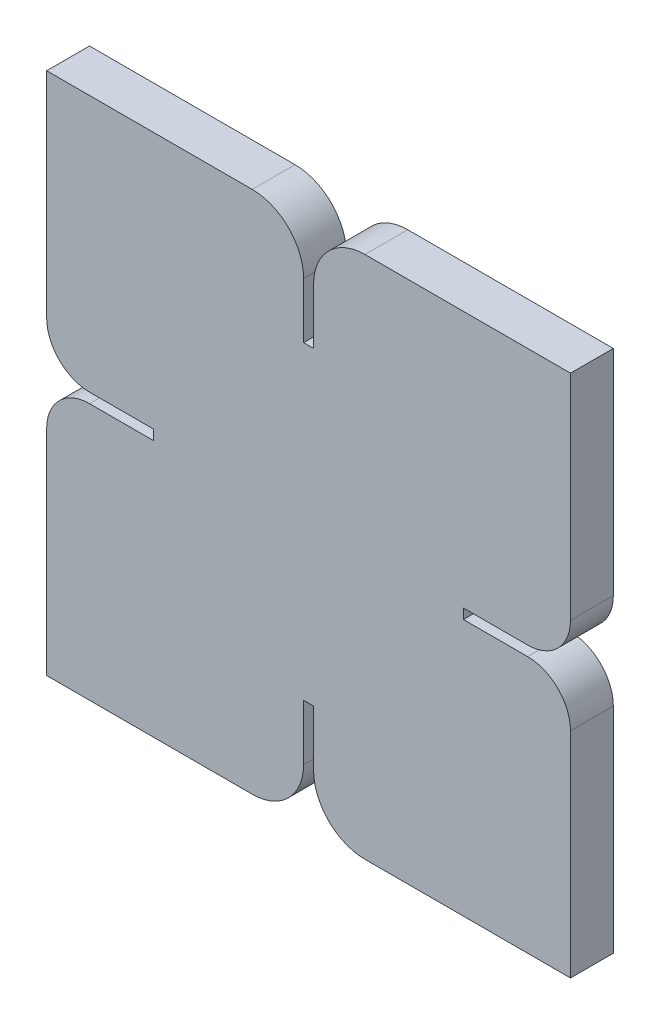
ISO-10303-21;
HEADER;
FILE_DESCRIPTION(('STEP AP214'),'2;1');
FILE_NAME('part.step','',(''),(''),'','','');
FILE_SCHEMA(('AUTOMOTIVE_DESIGN { 1 0 10303 214 1 1 1 1 }'));
ENDSEC;
DATA;
#1=APPLICATION_CONTEXT('core data for automotive mechanical design processes');
#2=APPLICATION_PROTOCOL_DEFINITION('international standard','automotive_design',2000,#1);
#3=PRODUCT_CONTEXT('',#1,'mechanical');
#4=PRODUCT('Part','Part','',(#3));
#5=PRODUCT_RELATED_PRODUCT_CATEGORY('part','',(#4));
#6=PRODUCT_DEFINITION_FORMATION('','',#4);
#7=PRODUCT_DEFINITION_CONTEXT('part definition',#1,'design');
#8=PRODUCT_DEFINITION('design','',#6,#7);
#9=PRODUCT_DEFINITION_SHAPE('','',#8);
#10=(LENGTH_UNIT() NAMED_UNIT(*) SI_UNIT(.MILLI.,.METRE.));
#11=(NAMED_UNIT(*) PLANE_ANGLE_UNIT() SI_UNIT($,.RADIAN.));
#12=(NAMED_UNIT(*) SI_UNIT($,.STERADIAN.) SOLID_ANGLE_UNIT());
#13=UNCERTAINTY_MEASURE_WITH_UNIT(LENGTH_MEASURE(1.E-05),#10,'distance_accuracy_value','');
#14=(GEOMETRIC_REPRESENTATION_CONTEXT(3) GLOBAL_UNCERTAINTY_ASSIGNED_CONTEXT((#13)) GLOBAL_UNIT_ASSIGNED_CONTEXT((#10,
#11,#12)) REPRESENTATION_CONTEXT('',''));
#15=CARTESIAN_POINT('',(0.,0.,0.));
#16=DIRECTION('',(0.,0.,1.));
#17=DIRECTION('',(1.,0.,0.));
#18=AXIS2_PLACEMENT_3D('',#15,#16,#17);
#19=CARTESIAN_POINT('',(-13.1666666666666,-49.1666666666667,10.));
#20=DIRECTION('',(0.,0.,-1.));
#21=DIRECTION('',(-1.,0.,0.));
#22=AXIS2_PLACEMENT_3D('',#19,#20,#21);
#23=CYLINDRICAL_SURFACE('',#22,12.);
#24=CARTESIAN_POINT('',(-13.1666666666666,-49.1666666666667,0.));
#25=DIRECTION('',(0.,0.,1.));
#26=DIRECTION('',(1.,0.,0.));
#27=AXIS2_PLACEMENT_3D('',#24,#25,#26);
#28=CIRCLE('',#27,12.);
#29=CARTESIAN_POINT('',(-1.16666666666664,-49.1666666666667,0.));
#30=VERTEX_POINT('',#29);
#31=CARTESIAN_POINT('',(-13.1666666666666,-61.1666666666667,0.));
#32=VERTEX_POINT('',#31);
#33=EDGE_CURVE('E251',#30,#32,#28,.F.);
#34=ORIENTED_EDGE('',*,*,#33,.F.);
#35=DIRECTION('',(0.,0.,-1.));
#36=VECTOR('',#35,1.);
#37=CARTESIAN_POINT('',(-1.16666666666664,-49.1666666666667,10.));
#38=LINE('',#37,#36);
#39=CARTESIAN_POINT('',(-1.16666666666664,-49.1666666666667,10.));
#40=VERTEX_POINT('',#39);
#41=EDGE_CURVE('E12',#40,#30,#38,.T.);
#42=ORIENTED_EDGE('',*,*,#41,.F.);
#43=CARTESIAN_POINT('',(-13.1666666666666,-49.1666666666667,10.));
#44=DIRECTION('',(0.,0.,1.));
#45=DIRECTION('',(1.,0.,0.));
#46=AXIS2_PLACEMENT_3D('',#43,#44,#45);
#47=CIRCLE('',#46,12.);
#48=CARTESIAN_POINT('',(-13.1666666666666,-61.1666666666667,10.));
#49=VERTEX_POINT('',#48);
#50=EDGE_CURVE('E386',#40,#49,#47,.F.);
#51=ORIENTED_EDGE('',*,*,#50,.T.);
#52=DIRECTION('',(0.,0.,-1.));
#53=VECTOR('',#52,1.);
#54=CARTESIAN_POINT('',(-13.1666666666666,-61.1666666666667,10.));
#55=LINE('',#54,#53);
#56=EDGE_CURVE('E151',#49,#32,#55,.T.);
#57=ORIENTED_EDGE('',*,*,#56,.T.);
#58=EDGE_LOOP('',(#34,#42,#51,#57));
#59=FACE_BOUND('',#58,.T.);
#60=ADVANCED_FACE('F40',(#59),#23,.T.);
#61=CARTESIAN_POINT('',(-1.16666666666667,0.,10.));
#62=DIRECTION('',(1.,0.,0.));
#63=DIRECTION('',(0.,1.,0.));
#64=AXIS2_PLACEMENT_3D('',#61,#62,#63);
#65=PLANE('',#64);
#66=DIRECTION('',(0.,-1.,0.));
#67=VECTOR('',#66,1.);
#68=CARTESIAN_POINT('',(-1.16666666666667,0.,0.));
#69=LINE('',#68,#67);
#70=CARTESIAN_POINT('',(-1.16666666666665,-36.1666666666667,0.));
#71=VERTEX_POINT('',#70);
#72=EDGE_CURVE('E254',#71,#30,#69,.T.);
#73=ORIENTED_EDGE('',*,*,#72,.F.);
#74=DIRECTION('',(0.,0.,-1.));
#75=VECTOR('',#74,1.);
#76=CARTESIAN_POINT('',(-1.16666666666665,-36.1666666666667,10.));
#77=LINE('',#76,#75);
#78=CARTESIAN_POINT('',(-1.16666666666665,-36.1666666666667,10.));
#79=VERTEX_POINT('',#78);
#80=EDGE_CURVE('E48',#79,#71,#77,.T.);
#81=ORIENTED_EDGE('',*,*,#80,.F.);
#82=DIRECTION('',(0.,-1.,0.));
#83=VECTOR('',#82,1.);
#84=CARTESIAN_POINT('',(-1.16666666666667,0.,10.));
#85=LINE('',#84,#83);
#86=EDGE_CURVE('E454',#79,#40,#85,.T.);
#87=ORIENTED_EDGE('',*,*,#86,.T.);
#88=ORIENTED_EDGE('',*,*,#41,.T.);
#89=EDGE_LOOP('',(#73,#81,#87,#88));
#90=FACE_BOUND('',#89,.T.);
#91=ADVANCED_FACE('F453',(#90),#65,.T.);
#92=CARTESIAN_POINT('',(0.,-36.1666666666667,10.));
#93=DIRECTION('',(0.,1.,0.));
#94=DIRECTION('',(0.,0.,1.));
#95=AXIS2_PLACEMENT_3D('',#92,#93,#94);
#96=PLANE('',#95);
#97=DIRECTION('',(1.,0.,0.));
#98=VECTOR('',#97,1.);
#99=CARTESIAN_POINT('',(0.,-36.1666666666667,0.));
#100=LINE('',#99,#98);
#101=CARTESIAN_POINT('',(1.16666666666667,-36.1666666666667,0.));
#102=VERTEX_POINT('',#101);
#103=EDGE_CURVE('E259',#71,#102,#100,.T.);
#104=ORIENTED_EDGE('',*,*,#103,.T.);
#105=DIRECTION('',(0.,0.,-1.));
#106=VECTOR('',#105,1.);
#107=CARTESIAN_POINT('',(1.16666666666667,-36.1666666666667,10.));
#108=LINE('',#107,#106);
#109=CARTESIAN_POINT('',(1.16666666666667,-36.1666666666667,10.));
#110=VERTEX_POINT('',#109);
#111=EDGE_CURVE('E437',#110,#102,#108,.T.);
#112=ORIENTED_EDGE('',*,*,#111,.F.);
#113=DIRECTION('',(1.,0.,0.));
#114=VECTOR('',#113,1.);
#115=CARTESIAN_POINT('',(0.,-36.1666666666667,10.));
#116=LINE('',#115,#114);
#117=EDGE_CURVE('E444',#79,#110,#116,.T.);
#118=ORIENTED_EDGE('',*,*,#117,.F.);
#119=ORIENTED_EDGE('',*,*,#80,.T.);
#120=EDGE_LOOP('',(#104,#112,#118,#119));
#121=FACE_BOUND('',#120,.T.);
#122=ADVANCED_FACE('F442',(#121),#96,.F.);
#123=CARTESIAN_POINT('',(1.16666666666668,0.,10.));
#124=DIRECTION('',(1.,0.,0.));
#125=DIRECTION('',(0.,1.,0.));
#126=AXIS2_PLACEMENT_3D('',#123,#124,#125);
#127=PLANE('',#126);
#128=DIRECTION('',(0.,-1.,0.));
#129=VECTOR('',#128,1.);
#130=CARTESIAN_POINT('',(1.16666666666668,0.,0.));
#131=LINE('',#130,#129);
#132=CARTESIAN_POINT('',(1.16666666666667,-49.1666666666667,0.));
#133=VERTEX_POINT('',#132);
#134=EDGE_CURVE('E263',#102,#133,#131,.T.);
#135=ORIENTED_EDGE('',*,*,#134,.T.);
#136=DIRECTION('',(0.,0.,-1.));
#137=VECTOR('',#136,1.);
#138=CARTESIAN_POINT('',(1.16666666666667,-49.1666666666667,10.));
#139=LINE('',#138,#137);
#140=CARTESIAN_POINT('',(1.16666666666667,-49.1666666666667,10.));
#141=VERTEX_POINT('',#140);
#142=EDGE_CURVE('E434',#141,#133,#139,.T.);
#143=ORIENTED_EDGE('',*,*,#142,.F.);
#144=DIRECTION('',(0.,-1.,0.));
#145=VECTOR('',#144,1.);
#146=CARTESIAN_POINT('',(1.16666666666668,0.,10.));
#147=LINE('',#146,#145);
#148=EDGE_CURVE('E462',#110,#141,#147,.T.);
#149=ORIENTED_EDGE('',*,*,#148,.F.);
#150=ORIENTED_EDGE('',*,*,#111,.T.);
#151=EDGE_LOOP('',(#135,#143,#149,#150));
#152=FACE_BOUND('',#151,.T.);
#153=ADVANCED_FACE('F532',(#152),#127,.F.);
#154=CARTESIAN_POINT('',(13.1666666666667,-49.1666666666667,10.));
#155=DIRECTION('',(0.,0.,-1.));
#156=DIRECTION('',(-1.,0.,0.));
#157=AXIS2_PLACEMENT_3D('',#154,#155,#156);
#158=CYLINDRICAL_SURFACE('',#157,12.);
#159=CARTESIAN_POINT('',(13.1666666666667,-49.1666666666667,0.));
#160=DIRECTION('',(0.,0.,1.));
#161=DIRECTION('',(1.,0.,0.));
#162=AXIS2_PLACEMENT_3D('',#159,#160,#161);
#163=CIRCLE('',#162,12.);
#164=CARTESIAN_POINT('',(13.1666666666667,-61.1666666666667,0.));
#165=VERTEX_POINT('',#164);
#166=EDGE_CURVE('E271',#133,#165,#163,.T.);
#167=ORIENTED_EDGE('',*,*,#166,.T.);
#168=DIRECTION('',(0.,0.,-1.));
#169=VECTOR('',#168,1.);
#170=CARTESIAN_POINT('',(13.1666666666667,-61.1666666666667,10.));
#171=LINE('',#170,#169);
#172=CARTESIAN_POINT('',(13.1666666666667,-61.1666666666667,10.));
#173=VERTEX_POINT('',#172);
#174=EDGE_CURVE('E432',#173,#165,#171,.T.);
#175=ORIENTED_EDGE('',*,*,#174,.F.);
#176=CARTESIAN_POINT('',(13.1666666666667,-49.1666666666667,10.));
#177=DIRECTION('',(0.,0.,1.));
#178=DIRECTION('',(1.,0.,0.));
#179=AXIS2_PLACEMENT_3D('',#176,#177,#178);
#180=CIRCLE('',#179,12.);
#181=EDGE_CURVE('E464',#141,#173,#180,.T.);
#182=ORIENTED_EDGE('',*,*,#181,.F.);
#183=ORIENTED_EDGE('',*,*,#142,.T.);
#184=EDGE_LOOP('',(#167,#175,#182,#183));
#185=FACE_BOUND('',#184,.T.);
#186=ADVANCED_FACE('F536',(#185),#158,.T.);
#187=CARTESIAN_POINT('',(0.,-61.1666666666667,10.));
#188=DIRECTION('',(0.,-1.,0.));
#189=DIRECTION('',(1.,0.,0.));
#190=AXIS2_PLACEMENT_3D('',#187,#188,#189);
#191=PLANE('',#190);
#192=DIRECTION('',(-1.,0.,0.));
#193=VECTOR('',#192,1.);
#194=CARTESIAN_POINT('',(0.,-61.1666666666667,0.));
#195=LINE('',#194,#193);
#196=CARTESIAN_POINT('',(61.1666666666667,-61.1666666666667,0.));
#197=VERTEX_POINT('',#196);
#198=EDGE_CURVE('E275',#197,#165,#195,.T.);
#199=ORIENTED_EDGE('',*,*,#198,.F.);
#200=DIRECTION('',(0.,0.,-1.));
#201=VECTOR('',#200,1.);
#202=CARTESIAN_POINT('',(61.1666666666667,-61.1666666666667,10.));
#203=LINE('',#202,#201);
#204=CARTESIAN_POINT('',(61.1666666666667,-61.1666666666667,10.));
#205=VERTEX_POINT('',#204);
#206=EDGE_CURVE('E430',#205,#197,#203,.T.);
#207=ORIENTED_EDGE('',*,*,#206,.F.);
#208=DIRECTION('',(-1.,0.,0.));
#209=VECTOR('',#208,1.);
#210=CARTESIAN_POINT('',(0.,-61.1666666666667,10.));
#211=LINE('',#210,#209);
#212=EDGE_CURVE('E466',#205,#173,#211,.T.);
#213=ORIENTED_EDGE('',*,*,#212,.T.);
#214=ORIENTED_EDGE('',*,*,#174,.T.);
#215=EDGE_LOOP('',(#199,#207,#213,#214));
#216=FACE_BOUND('',#215,.T.);
#217=ADVANCED_FACE('F541',(#216),#191,.T.);
#218=CARTESIAN_POINT('',(61.1666666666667,0.,10.));
#219=DIRECTION('',(1.,0.,0.));
#220=DIRECTION('',(0.,1.,0.));
#221=AXIS2_PLACEMENT_3D('',#218,#219,#220);
#222=PLANE('',#221);
#223=DIRECTION('',(0.,-1.,0.));
#224=VECTOR('',#223,1.);
#225=CARTESIAN_POINT('',(61.1666666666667,0.,0.));
#226=LINE('',#225,#224);
#227=CARTESIAN_POINT('',(61.1666666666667,-11.1666666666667,0.));
#228=VERTEX_POINT('',#227);
#229=EDGE_CURVE('E280',#228,#197,#226,.T.);
#230=ORIENTED_EDGE('',*,*,#229,.F.);
#231=DIRECTION('',(0.,0.,-1.));
#232=VECTOR('',#231,1.);
#233=CARTESIAN_POINT('',(61.1666666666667,-11.1666666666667,10.));
#234=LINE('',#233,#232);
#235=CARTESIAN_POINT('',(61.1666666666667,-11.1666666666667,10.));
#236=VERTEX_POINT('',#235);
#237=EDGE_CURVE('E428',#236,#228,#234,.T.);
#238=ORIENTED_EDGE('',*,*,#237,.F.);
#239=DIRECTION('',(0.,-1.,0.));
#240=VECTOR('',#239,1.);
#241=CARTESIAN_POINT('',(61.1666666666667,0.,10.));
#242=LINE('',#241,#240);
#243=EDGE_CURVE('E469',#236,#205,#242,.T.);
#244=ORIENTED_EDGE('',*,*,#243,.T.);
#245=ORIENTED_EDGE('',*,*,#206,.T.);
#246=EDGE_LOOP('',(#230,#238,#244,#245));
#247=FACE_BOUND('',#246,.T.);
#248=ADVANCED_FACE('F546',(#247),#222,.T.);
#249=CARTESIAN_POINT('',(51.1666666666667,-11.1666666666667,10.));
#250=DIRECTION('',(0.,0.,-1.));
#251=DIRECTION('',(-1.,0.,0.));
#252=AXIS2_PLACEMENT_3D('',#249,#250,#251);
#253=CYLINDRICAL_SURFACE('',#252,10.);
#254=CARTESIAN_POINT('',(51.1666666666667,-11.1666666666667,0.));
#255=DIRECTION('',(0.,0.,1.));
#256=DIRECTION('',(1.,0.,0.));
#257=AXIS2_PLACEMENT_3D('',#254,#255,#256);
#258=CIRCLE('',#257,10.);
#259=CARTESIAN_POINT('',(51.1666666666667,-1.16666666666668,0.));
#260=VERTEX_POINT('',#259);
#261=EDGE_CURVE('E285',#260,#228,#258,.F.);
#262=ORIENTED_EDGE('',*,*,#261,.F.);
#263=DIRECTION('',(0.,0.,-1.));
#264=VECTOR('',#263,1.);
#265=CARTESIAN_POINT('',(51.1666666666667,-1.16666666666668,10.));
#266=LINE('',#265,#264);
#267=CARTESIAN_POINT('',(51.1666666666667,-1.16666666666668,10.));
#268=VERTEX_POINT('',#267);
#269=EDGE_CURVE('E426',#268,#260,#266,.T.);
#270=ORIENTED_EDGE('',*,*,#269,.F.);
#271=CARTESIAN_POINT('',(51.1666666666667,-11.1666666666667,10.));
#272=DIRECTION('',(0.,0.,1.));
#273=DIRECTION('',(1.,0.,0.));
#274=AXIS2_PLACEMENT_3D('',#271,#272,#273);
#275=CIRCLE('',#274,10.);
#276=EDGE_CURVE('E472',#268,#236,#275,.F.);
#277=ORIENTED_EDGE('',*,*,#276,.T.);
#278=ORIENTED_EDGE('',*,*,#237,.T.);
#279=EDGE_LOOP('',(#262,#270,#277,#278));
#280=FACE_BOUND('',#279,.T.);
#281=ADVANCED_FACE('F549',(#280),#253,.T.);
#282=CARTESIAN_POINT('',(0.,-1.16666666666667,10.));
#283=DIRECTION('',(0.,-1.,0.));
#284=DIRECTION('',(1.,0.,0.));
#285=AXIS2_PLACEMENT_3D('',#282,#283,#284);
#286=PLANE('',#285);
#287=DIRECTION('',(-1.,0.,0.));
#288=VECTOR('',#287,1.);
#289=CARTESIAN_POINT('',(0.,-1.16666666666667,0.));
#290=LINE('',#289,#288);
#291=CARTESIAN_POINT('',(36.1666666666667,-1.16666666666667,0.));
#292=VERTEX_POINT('',#291);
#293=EDGE_CURVE('E291',#260,#292,#290,.T.);
#294=ORIENTED_EDGE('',*,*,#293,.T.);
#295=DIRECTION('',(0.,0.,-1.));
#296=VECTOR('',#295,1.);
#297=CARTESIAN_POINT('',(36.1666666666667,-1.16666666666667,10.));
#298=LINE('',#297,#296);
#299=CARTESIAN_POINT('',(36.1666666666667,-1.16666666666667,10.));
#300=VERTEX_POINT('',#299);
#301=EDGE_CURVE('E424',#300,#292,#298,.T.);
#302=ORIENTED_EDGE('',*,*,#301,.F.);
#303=DIRECTION('',(-1.,0.,0.));
#304=VECTOR('',#303,1.);
#305=CARTESIAN_POINT('',(0.,-1.16666666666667,10.));
#306=LINE('',#305,#304);
#307=EDGE_CURVE('E475',#268,#300,#306,.T.);
#308=ORIENTED_EDGE('',*,*,#307,.F.);
#309=ORIENTED_EDGE('',*,*,#269,.T.);
#310=EDGE_LOOP('',(#294,#302,#308,#309));
#311=FACE_BOUND('',#310,.T.);
#312=ADVANCED_FACE('F555',(#311),#286,.F.);
#313=CARTESIAN_POINT('',(36.1666666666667,0.,10.));
#314=DIRECTION('',(1.,0.,0.));
#315=DIRECTION('',(0.,0.,-1.));
#316=AXIS2_PLACEMENT_3D('',#313,#314,#315);
#317=PLANE('',#316);
#318=DIRECTION('',(0.,-1.,0.));
#319=VECTOR('',#318,1.);
#320=CARTESIAN_POINT('',(36.1666666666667,0.,0.));
#321=LINE('',#320,#319);
#322=CARTESIAN_POINT('',(36.1666666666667,1.16666666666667,0.));
#323=VERTEX_POINT('',#322);
#324=EDGE_CURVE('E295',#323,#292,#321,.T.);
#325=ORIENTED_EDGE('',*,*,#324,.F.);
#326=DIRECTION('',(0.,0.,-1.));
#327=VECTOR('',#326,1.);
#328=CARTESIAN_POINT('',(36.1666666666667,1.16666666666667,10.));
#329=LINE('',#328,#327);
#330=CARTESIAN_POINT('',(36.1666666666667,1.16666666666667,10.));
#331=VERTEX_POINT('',#330);
#332=EDGE_CURVE('E422',#331,#323,#329,.T.);
#333=ORIENTED_EDGE('',*,*,#332,.F.);
#334=DIRECTION('',(0.,-1.,0.));
#335=VECTOR('',#334,1.);
#336=CARTESIAN_POINT('',(36.1666666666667,0.,10.));
#337=LINE('',#336,#335);
#338=EDGE_CURVE('E477',#331,#300,#337,.T.);
#339=ORIENTED_EDGE('',*,*,#338,.T.);
#340=ORIENTED_EDGE('',*,*,#301,.T.);
#341=EDGE_LOOP('',(#325,#333,#339,#340));
#342=FACE_BOUND('',#341,.T.);
#343=ADVANCED_FACE('F559',(#342),#317,.T.);
#344=CARTESIAN_POINT('',(0.,1.16666666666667,10.));
#345=DIRECTION('',(0.,-1.,0.));
#346=DIRECTION('',(1.,0.,0.));
#347=AXIS2_PLACEMENT_3D('',#344,#345,#346);
#348=PLANE('',#347);
#349=DIRECTION('',(-1.,0.,0.));
#350=VECTOR('',#349,1.);
#351=CARTESIAN_POINT('',(0.,1.16666666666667,0.));
#352=LINE('',#351,#350);
#353=CARTESIAN_POINT('',(51.1666666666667,1.16666666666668,0.));
#354=VERTEX_POINT('',#353);
#355=EDGE_CURVE('E300',#354,#323,#352,.T.);
#356=ORIENTED_EDGE('',*,*,#355,.F.);
#357=DIRECTION('',(0.,0.,-1.));
#358=VECTOR('',#357,1.);
#359=CARTESIAN_POINT('',(51.1666666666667,1.16666666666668,10.));
#360=LINE('',#359,#358);
#361=CARTESIAN_POINT('',(51.1666666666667,1.16666666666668,10.));
#362=VERTEX_POINT('',#361);
#363=EDGE_CURVE('E420',#362,#354,#360,.T.);
#364=ORIENTED_EDGE('',*,*,#363,.F.);
#365=DIRECTION('',(-1.,0.,0.));
#366=VECTOR('',#365,1.);
#367=CARTESIAN_POINT('',(0.,1.16666666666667,10.));
#368=LINE('',#367,#366);
#369=EDGE_CURVE('E480',#362,#331,#368,.T.);
#370=ORIENTED_EDGE('',*,*,#369,.T.);
#371=ORIENTED_EDGE('',*,*,#332,.T.);
#372=EDGE_LOOP('',(#356,#364,#370,#371));
#373=FACE_BOUND('',#372,.T.);
#374=ADVANCED_FACE('F562',(#373),#348,.T.);
#375=CARTESIAN_POINT('',(51.1666666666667,11.1666666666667,10.));
#376=DIRECTION('',(0.,0.,-1.));
#377=DIRECTION('',(-1.,0.,0.));
#378=AXIS2_PLACEMENT_3D('',#375,#376,#377);
#379=CYLINDRICAL_SURFACE('',#378,10.);
#380=CARTESIAN_POINT('',(51.1666666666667,11.1666666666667,0.));
#381=DIRECTION('',(0.,0.,1.));
#382=DIRECTION('',(1.,0.,0.));
#383=AXIS2_PLACEMENT_3D('',#380,#381,#382);
#384=CIRCLE('',#383,10.);
#385=CARTESIAN_POINT('',(61.1666666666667,11.1666666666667,0.));
#386=VERTEX_POINT('',#385);
#387=EDGE_CURVE('E305',#354,#386,#384,.T.);
#388=ORIENTED_EDGE('',*,*,#387,.T.);
#389=DIRECTION('',(0.,0.,-1.));
#390=VECTOR('',#389,1.);
#391=CARTESIAN_POINT('',(61.1666666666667,11.1666666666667,10.));
#392=LINE('',#391,#390);
#393=CARTESIAN_POINT('',(61.1666666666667,11.1666666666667,10.));
#394=VERTEX_POINT('',#393);
#395=EDGE_CURVE('E417',#394,#386,#392,.T.);
#396=ORIENTED_EDGE('',*,*,#395,.F.);
#397=CARTESIAN_POINT('',(51.1666666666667,11.1666666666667,10.));
#398=DIRECTION('',(0.,0.,1.));
#399=DIRECTION('',(1.,0.,0.));
#400=AXIS2_PLACEMENT_3D('',#397,#398,#399);
#401=CIRCLE('',#400,10.);
#402=EDGE_CURVE('E483',#362,#394,#401,.T.);
#403=ORIENTED_EDGE('',*,*,#402,.F.);
#404=ORIENTED_EDGE('',*,*,#363,.T.);
#405=EDGE_LOOP('',(#388,#396,#403,#404));
#406=FACE_BOUND('',#405,.T.);
#407=ADVANCED_FACE('F568',(#406),#379,.T.);
#408=CARTESIAN_POINT('',(61.1666666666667,0.,10.));
#409=DIRECTION('',(-1.,0.,0.));
#410=DIRECTION('',(0.,-1.,0.));
#411=AXIS2_PLACEMENT_3D('',#408,#409,#410);
#412=PLANE('',#411);
#413=DIRECTION('',(0.,1.,0.));
#414=VECTOR('',#413,1.);
#415=CARTESIAN_POINT('',(61.1666666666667,0.,0.));
#416=LINE('',#415,#414);
#417=CARTESIAN_POINT('',(61.1666666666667,61.1666666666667,0.));
#418=VERTEX_POINT('',#417);
#419=EDGE_CURVE('E313',#386,#418,#416,.T.);
#420=ORIENTED_EDGE('',*,*,#419,.T.);
#421=DIRECTION('',(0.,0.,-1.));
#422=VECTOR('',#421,1.);
#423=CARTESIAN_POINT('',(61.1666666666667,61.1666666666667,10.));
#424=LINE('',#423,#422);
#425=CARTESIAN_POINT('',(61.1666666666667,61.1666666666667,10.));
#426=VERTEX_POINT('',#425);
#427=EDGE_CURVE('E414',#426,#418,#424,.T.);
#428=ORIENTED_EDGE('',*,*,#427,.F.);
#429=DIRECTION('',(0.,1.,0.));
#430=VECTOR('',#429,1.);
#431=CARTESIAN_POINT('',(61.1666666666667,0.,10.));
#432=LINE('',#431,#430);
#433=EDGE_CURVE('E485',#394,#426,#432,.T.);
#434=ORIENTED_EDGE('',*,*,#433,.F.);
#435=ORIENTED_EDGE('',*,*,#395,.T.);
#436=EDGE_LOOP('',(#420,#428,#434,#435));
#437=FACE_BOUND('',#436,.T.);
#438=ADVANCED_FACE('F572',(#437),#412,.F.);
#439=CARTESIAN_POINT('',(0.,61.1666666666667,10.));
#440=DIRECTION('',(0.,-1.,0.));
#441=DIRECTION('',(1.,0.,0.));
#442=AXIS2_PLACEMENT_3D('',#439,#440,#441);
#443=PLANE('',#442);
#444=DIRECTION('',(-1.,0.,0.));
#445=VECTOR('',#444,1.);
#446=CARTESIAN_POINT('',(0.,61.1666666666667,0.));
#447=LINE('',#446,#445);
#448=CARTESIAN_POINT('',(13.1666666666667,61.1666666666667,0.));
#449=VERTEX_POINT('',#448);
#450=EDGE_CURVE('E316',#418,#449,#447,.T.);
#451=ORIENTED_EDGE('',*,*,#450,.T.);
#452=DIRECTION('',(0.,0.,-1.));
#453=VECTOR('',#452,1.);
#454=CARTESIAN_POINT('',(13.1666666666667,61.1666666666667,10.));
#455=LINE('',#454,#453);
#456=CARTESIAN_POINT('',(13.1666666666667,61.1666666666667,10.));
#457=VERTEX_POINT('',#456);
#458=EDGE_CURVE('E412',#457,#449,#455,.T.);
#459=ORIENTED_EDGE('',*,*,#458,.F.);
#460=DIRECTION('',(-1.,0.,0.));
#461=VECTOR('',#460,1.);
#462=CARTESIAN_POINT('',(0.,61.1666666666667,10.));
#463=LINE('',#462,#461);
#464=EDGE_CURVE('E487',#426,#457,#463,.T.);
#465=ORIENTED_EDGE('',*,*,#464,.F.);
#466=ORIENTED_EDGE('',*,*,#427,.T.);
#467=EDGE_LOOP('',(#451,#459,#465,#466));
#468=FACE_BOUND('',#467,.T.);
#469=ADVANCED_FACE('F577',(#468),#443,.F.);
#470=CARTESIAN_POINT('',(13.1666666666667,49.1666666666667,10.));
#471=DIRECTION('',(0.,0.,-1.));
#472=DIRECTION('',(-1.,0.,0.));
#473=AXIS2_PLACEMENT_3D('',#470,#471,#472);
#474=CYLINDRICAL_SURFACE('',#473,12.);
#475=CARTESIAN_POINT('',(13.1666666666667,49.1666666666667,0.));
#476=DIRECTION('',(0.,0.,1.));
#477=DIRECTION('',(1.,0.,0.));
#478=AXIS2_PLACEMENT_3D('',#475,#476,#477);
#479=CIRCLE('',#478,12.);
#480=CARTESIAN_POINT('',(1.16666666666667,49.1666666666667,0.));
#481=VERTEX_POINT('',#480);
#482=EDGE_CURVE('E321',#481,#449,#479,.F.);
#483=ORIENTED_EDGE('',*,*,#482,.F.);
#484=DIRECTION('',(0.,0.,-1.));
#485=VECTOR('',#484,1.);
#486=CARTESIAN_POINT('',(1.16666666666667,49.1666666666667,10.));
#487=LINE('',#486,#485);
#488=CARTESIAN_POINT('',(1.16666666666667,49.1666666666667,10.));
#489=VERTEX_POINT('',#488);
#490=EDGE_CURVE('E410',#489,#481,#487,.T.);
#491=ORIENTED_EDGE('',*,*,#490,.F.);
#492=CARTESIAN_POINT('',(13.1666666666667,49.1666666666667,10.));
#493=DIRECTION('',(0.,0.,1.));
#494=DIRECTION('',(1.,0.,0.));
#495=AXIS2_PLACEMENT_3D('',#492,#493,#494);
#496=CIRCLE('',#495,12.);
#497=EDGE_CURVE('E489',#489,#457,#496,.F.);
#498=ORIENTED_EDGE('',*,*,#497,.T.);
#499=ORIENTED_EDGE('',*,*,#458,.T.);
#500=EDGE_LOOP('',(#483,#491,#498,#499));
#501=FACE_BOUND('',#500,.T.);
#502=ADVANCED_FACE('F619',(#501),#474,.T.);
#503=CARTESIAN_POINT('',(1.16666666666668,0.,10.));
#504=DIRECTION('',(-1.,0.,0.));
#505=DIRECTION('',(0.,-1.,0.));
#506=AXIS2_PLACEMENT_3D('',#503,#504,#505);
#507=PLANE('',#506);
#508=DIRECTION('',(0.,1.,0.));
#509=VECTOR('',#508,1.);
#510=CARTESIAN_POINT('',(1.16666666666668,0.,0.));
#511=LINE('',#510,#509);
#512=CARTESIAN_POINT('',(1.16666666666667,36.1666666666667,0.));
#513=VERTEX_POINT('',#512);
#514=EDGE_CURVE('E325',#513,#481,#511,.T.);
#515=ORIENTED_EDGE('',*,*,#514,.F.);
#516=DIRECTION('',(0.,0.,-1.));
#517=VECTOR('',#516,1.);
#518=CARTESIAN_POINT('',(1.16666666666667,36.1666666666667,10.));
#519=LINE('',#518,#517);
#520=CARTESIAN_POINT('',(1.16666666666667,36.1666666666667,10.));
#521=VERTEX_POINT('',#520);
#522=EDGE_CURVE('E408',#521,#513,#519,.T.);
#523=ORIENTED_EDGE('',*,*,#522,.F.);
#524=DIRECTION('',(0.,1.,0.));
#525=VECTOR('',#524,1.);
#526=CARTESIAN_POINT('',(1.16666666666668,0.,10.));
#527=LINE('',#526,#525);
#528=EDGE_CURVE('E492',#521,#489,#527,.T.);
#529=ORIENTED_EDGE('',*,*,#528,.T.);
#530=ORIENTED_EDGE('',*,*,#490,.T.);
#531=EDGE_LOOP('',(#515,#523,#529,#530));
#532=FACE_BOUND('',#531,.T.);
#533=ADVANCED_FACE('F584',(#532),#507,.T.);
#534=CARTESIAN_POINT('',(0.,36.1666666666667,10.));
#535=DIRECTION('',(0.,1.,0.));
#536=DIRECTION('',(0.,0.,1.));
#537=AXIS2_PLACEMENT_3D('',#534,#535,#536);
#538=PLANE('',#537);
#539=DIRECTION('',(1.,0.,0.));
#540=VECTOR('',#539,1.);
#541=CARTESIAN_POINT('',(0.,36.1666666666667,0.));
#542=LINE('',#541,#540);
#543=CARTESIAN_POINT('',(-1.16666666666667,36.1666666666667,0.));
#544=VERTEX_POINT('',#543);
#545=EDGE_CURVE('E330',#544,#513,#542,.T.);
#546=ORIENTED_EDGE('',*,*,#545,.F.);
#547=DIRECTION('',(0.,0.,-1.));
#548=VECTOR('',#547,1.);
#549=CARTESIAN_POINT('',(-1.16666666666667,36.1666666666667,10.));
#550=LINE('',#549,#548);
#551=CARTESIAN_POINT('',(-1.16666666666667,36.1666666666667,10.));
#552=VERTEX_POINT('',#551);
#553=EDGE_CURVE('E406',#552,#544,#550,.T.);
#554=ORIENTED_EDGE('',*,*,#553,.F.);
#555=DIRECTION('',(1.,0.,0.));
#556=VECTOR('',#555,1.);
#557=CARTESIAN_POINT('',(0.,36.1666666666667,10.));
#558=LINE('',#557,#556);
#559=EDGE_CURVE('E495',#552,#521,#558,.T.);
#560=ORIENTED_EDGE('',*,*,#559,.T.);
#561=ORIENTED_EDGE('',*,*,#522,.T.);
#562=EDGE_LOOP('',(#546,#554,#560,#561));
#563=FACE_BOUND('',#562,.T.);
#564=ADVANCED_FACE('F588',(#563),#538,.T.);
#565=CARTESIAN_POINT('',(-1.16666666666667,0.,10.));
#566=DIRECTION('',(-1.,0.,0.));
#567=DIRECTION('',(0.,-1.,0.));
#568=AXIS2_PLACEMENT_3D('',#565,#566,#567);
#569=PLANE('',#568);
#570=DIRECTION('',(0.,1.,0.));
#571=VECTOR('',#570,1.);
#572=CARTESIAN_POINT('',(-1.16666666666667,0.,0.));
#573=LINE('',#572,#571);
#574=CARTESIAN_POINT('',(-1.16666666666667,49.1666666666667,0.));
#575=VERTEX_POINT('',#574);
#576=EDGE_CURVE('E338',#544,#575,#573,.T.);
#577=ORIENTED_EDGE('',*,*,#576,.T.);
#578=DIRECTION('',(0.,0.,-1.));
#579=VECTOR('',#578,1.);
#580=CARTESIAN_POINT('',(-1.16666666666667,49.1666666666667,10.));
#581=LINE('',#580,#579);
#582=CARTESIAN_POINT('',(-1.16666666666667,49.1666666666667,10.));
#583=VERTEX_POINT('',#582);
#584=EDGE_CURVE('E403',#583,#575,#581,.T.);
#585=ORIENTED_EDGE('',*,*,#584,.F.);
#586=DIRECTION('',(0.,1.,0.));
#587=VECTOR('',#586,1.);
#588=CARTESIAN_POINT('',(-1.16666666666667,0.,10.));
#589=LINE('',#588,#587);
#590=EDGE_CURVE('E498',#552,#583,#589,.T.);
#591=ORIENTED_EDGE('',*,*,#590,.F.);
#592=ORIENTED_EDGE('',*,*,#553,.T.);
#593=EDGE_LOOP('',(#577,#585,#591,#592));
#594=FACE_BOUND('',#593,.T.);
#595=ADVANCED_FACE('F595',(#594),#569,.F.);
#596=CARTESIAN_POINT('',(-13.1666666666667,49.1666666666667,10.));
#597=DIRECTION('',(0.,0.,-1.));
#598=DIRECTION('',(-1.,0.,0.));
#599=AXIS2_PLACEMENT_3D('',#596,#597,#598);
#600=CYLINDRICAL_SURFACE('',#599,12.);
#601=CARTESIAN_POINT('',(-13.1666666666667,49.1666666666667,0.));
#602=DIRECTION('',(0.,0.,1.));
#603=DIRECTION('',(1.,0.,0.));
#604=AXIS2_PLACEMENT_3D('',#601,#602,#603);
#605=CIRCLE('',#604,12.);
#606=CARTESIAN_POINT('',(-13.1666666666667,61.1666666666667,0.));
#607=VERTEX_POINT('',#606);
#608=EDGE_CURVE('E341',#575,#607,#605,.T.);
#609=ORIENTED_EDGE('',*,*,#608,.T.);
#610=DIRECTION('',(0.,0.,-1.));
#611=VECTOR('',#610,1.);
#612=CARTESIAN_POINT('',(-13.1666666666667,61.1666666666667,10.));
#613=LINE('',#612,#611);
#614=CARTESIAN_POINT('',(-13.1666666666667,61.1666666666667,10.));
#615=VERTEX_POINT('',#614);
#616=EDGE_CURVE('E401',#615,#607,#613,.T.);
#617=ORIENTED_EDGE('',*,*,#616,.F.);
#618=CARTESIAN_POINT('',(-13.1666666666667,49.1666666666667,10.));
#619=DIRECTION('',(0.,0.,1.));
#620=DIRECTION('',(1.,0.,0.));
#621=AXIS2_PLACEMENT_3D('',#618,#619,#620);
#622=CIRCLE('',#621,12.);
#623=EDGE_CURVE('E500',#583,#615,#622,.T.);
#624=ORIENTED_EDGE('',*,*,#623,.F.);
#625=ORIENTED_EDGE('',*,*,#584,.T.);
#626=EDGE_LOOP('',(#609,#617,#624,#625));
#627=FACE_BOUND('',#626,.T.);
#628=ADVANCED_FACE('F599',(#627),#600,.T.);
#629=CARTESIAN_POINT('',(0.,61.1666666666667,10.));
#630=DIRECTION('',(0.,1.,0.));
#631=DIRECTION('',(0.,0.,1.));
#632=AXIS2_PLACEMENT_3D('',#629,#630,#631);
#633=PLANE('',#632);
#634=DIRECTION('',(1.,0.,0.));
#635=VECTOR('',#634,1.);
#636=CARTESIAN_POINT('',(0.,61.1666666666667,0.));
#637=LINE('',#636,#635);
#638=CARTESIAN_POINT('',(-61.1666666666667,61.1666666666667,0.));
#639=VERTEX_POINT('',#638);
#640=EDGE_CURVE('E346',#639,#607,#637,.T.);
#641=ORIENTED_EDGE('',*,*,#640,.F.);
#642=DIRECTION('',(0.,0.,-1.));
#643=VECTOR('',#642,1.);
#644=CARTESIAN_POINT('',(-61.1666666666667,61.1666666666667,10.));
#645=LINE('',#644,#643);
#646=CARTESIAN_POINT('',(-61.1666666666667,61.1666666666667,10.));
#647=VERTEX_POINT('',#646);
#648=EDGE_CURVE('E399',#647,#639,#645,.T.);
#649=ORIENTED_EDGE('',*,*,#648,.F.);
#650=DIRECTION('',(1.,0.,0.));
#651=VECTOR('',#650,1.);
#652=CARTESIAN_POINT('',(0.,61.1666666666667,10.));
#653=LINE('',#652,#651);
#654=EDGE_CURVE('E502',#647,#615,#653,.T.);
#655=ORIENTED_EDGE('',*,*,#654,.T.);
#656=ORIENTED_EDGE('',*,*,#616,.T.);
#657=EDGE_LOOP('',(#641,#649,#655,#656));
#658=FACE_BOUND('',#657,.T.);
#659=ADVANCED_FACE('F602',(#658),#633,.T.);
#660=CARTESIAN_POINT('',(-61.1666666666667,0.,10.));
#661=DIRECTION('',(-1.,0.,0.));
#662=DIRECTION('',(0.,-1.,0.));
#663=AXIS2_PLACEMENT_3D('',#660,#661,#662);
#664=PLANE('',#663);
#665=DIRECTION('',(0.,1.,0.));
#666=VECTOR('',#665,1.);
#667=CARTESIAN_POINT('',(-61.1666666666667,0.,0.));
#668=LINE('',#667,#666);
#669=CARTESIAN_POINT('',(-61.1666666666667,11.1666666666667,0.));
#670=VERTEX_POINT('',#669);
#671=EDGE_CURVE('E351',#670,#639,#668,.T.);
#672=ORIENTED_EDGE('',*,*,#671,.F.);
#673=DIRECTION('',(0.,0.,-1.));
#674=VECTOR('',#673,1.);
#675=CARTESIAN_POINT('',(-61.1666666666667,11.1666666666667,10.));
#676=LINE('',#675,#674);
#677=CARTESIAN_POINT('',(-61.1666666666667,11.1666666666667,10.));
#678=VERTEX_POINT('',#677);
#679=EDGE_CURVE('E397',#678,#670,#676,.T.);
#680=ORIENTED_EDGE('',*,*,#679,.F.);
#681=DIRECTION('',(0.,1.,0.));
#682=VECTOR('',#681,1.);
#683=CARTESIAN_POINT('',(-61.1666666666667,0.,10.));
#684=LINE('',#683,#682);
#685=EDGE_CURVE('E505',#678,#647,#684,.T.);
#686=ORIENTED_EDGE('',*,*,#685,.T.);
#687=ORIENTED_EDGE('',*,*,#648,.T.);
#688=EDGE_LOOP('',(#672,#680,#686,#687));
#689=FACE_BOUND('',#688,.T.);
#690=ADVANCED_FACE('F607',(#689),#664,.T.);
#691=CARTESIAN_POINT('',(-51.1666666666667,11.1666666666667,10.));
#692=DIRECTION('',(0.,0.,-1.));
#693=DIRECTION('',(-1.,0.,0.));
#694=AXIS2_PLACEMENT_3D('',#691,#692,#693);
#695=CYLINDRICAL_SURFACE('',#694,10.);
#696=CARTESIAN_POINT('',(-51.1666666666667,11.1666666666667,0.));
#697=DIRECTION('',(0.,0.,1.));
#698=DIRECTION('',(1.,0.,0.));
#699=AXIS2_PLACEMENT_3D('',#696,#697,#698);
#700=CIRCLE('',#699,10.);
#701=CARTESIAN_POINT('',(-51.1666666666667,1.16666666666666,0.));
#702=VERTEX_POINT('',#701);
#703=EDGE_CURVE('E364',#702,#670,#700,.F.);
#704=ORIENTED_EDGE('',*,*,#703,.F.);
#705=DIRECTION('',(0.,0.,-1.));
#706=VECTOR('',#705,1.);
#707=CARTESIAN_POINT('',(-51.1666666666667,1.16666666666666,10.));
#708=LINE('',#707,#706);
#709=CARTESIAN_POINT('',(-51.1666666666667,1.16666666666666,10.));
#710=VERTEX_POINT('',#709);
#711=EDGE_CURVE('E395',#710,#702,#708,.T.);
#712=ORIENTED_EDGE('',*,*,#711,.F.);
#713=CARTESIAN_POINT('',(-51.1666666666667,11.1666666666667,10.));
#714=DIRECTION('',(0.,0.,1.));
#715=DIRECTION('',(1.,0.,0.));
#716=AXIS2_PLACEMENT_3D('',#713,#714,#715);
#717=CIRCLE('',#716,10.);
#718=EDGE_CURVE('E508',#710,#678,#717,.F.);
#719=ORIENTED_EDGE('',*,*,#718,.T.);
#720=ORIENTED_EDGE('',*,*,#679,.T.);
#721=EDGE_LOOP('',(#704,#712,#719,#720));
#722=FACE_BOUND('',#721,.T.);
#723=ADVANCED_FACE('F610',(#722),#695,.T.);
#724=CARTESIAN_POINT('',(0.,1.16666666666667,10.));
#725=DIRECTION('',(0.,1.,0.));
#726=DIRECTION('',(-1.,0.,0.));
#727=AXIS2_PLACEMENT_3D('',#724,#725,#726);
#728=PLANE('',#727);
#729=DIRECTION('',(1.,0.,0.));
#730=VECTOR('',#729,1.);
#731=CARTESIAN_POINT('',(0.,1.16666666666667,0.));
#732=LINE('',#731,#730);
#733=CARTESIAN_POINT('',(-36.1666666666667,1.16666666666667,0.));
#734=VERTEX_POINT('',#733);
#735=EDGE_CURVE('E360',#702,#734,#732,.T.);
#736=ORIENTED_EDGE('',*,*,#735,.T.);
#737=DIRECTION('',(0.,0.,-1.));
#738=VECTOR('',#737,1.);
#739=CARTESIAN_POINT('',(-36.1666666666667,1.16666666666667,10.));
#740=LINE('',#739,#738);
#741=CARTESIAN_POINT('',(-36.1666666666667,1.16666666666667,10.));
#742=VERTEX_POINT('',#741);
#743=EDGE_CURVE('E392',#742,#734,#740,.T.);
#744=ORIENTED_EDGE('',*,*,#743,.F.);
#745=DIRECTION('',(1.,0.,0.));
#746=VECTOR('',#745,1.);
#747=CARTESIAN_POINT('',(0.,1.16666666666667,10.));
#748=LINE('',#747,#746);
#749=EDGE_CURVE('E511',#710,#742,#748,.T.);
#750=ORIENTED_EDGE('',*,*,#749,.F.);
#751=ORIENTED_EDGE('',*,*,#711,.T.);
#752=EDGE_LOOP('',(#736,#744,#750,#751));
#753=FACE_BOUND('',#752,.T.);
#754=ADVANCED_FACE('F615',(#753),#728,.F.);
#755=CARTESIAN_POINT('',(-36.1666666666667,0.,10.));
#756=DIRECTION('',(1.,0.,0.));
#757=DIRECTION('',(0.,0.,-1.));
#758=AXIS2_PLACEMENT_3D('',#755,#756,#757);
#759=PLANE('',#758);
#760=DIRECTION('',(0.,-1.,0.));
#761=VECTOR('',#760,1.);
#762=CARTESIAN_POINT('',(-36.1666666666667,0.,0.));
#763=LINE('',#762,#761);
#764=CARTESIAN_POINT('',(-36.1666666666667,-1.16666666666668,0.));
#765=VERTEX_POINT('',#764);
#766=EDGE_CURVE('E363',#734,#765,#763,.T.);
#767=ORIENTED_EDGE('',*,*,#766,.T.);
#768=DIRECTION('',(0.,0.,-1.));
#769=VECTOR('',#768,1.);
#770=CARTESIAN_POINT('',(-36.1666666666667,-1.16666666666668,10.));
#771=LINE('',#770,#769);
#772=CARTESIAN_POINT('',(-36.1666666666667,-1.16666666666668,10.));
#773=VERTEX_POINT('',#772);
#774=EDGE_CURVE('E390',#773,#765,#771,.T.);
#775=ORIENTED_EDGE('',*,*,#774,.F.);
#776=DIRECTION('',(0.,-1.,0.));
#777=VECTOR('',#776,1.);
#778=CARTESIAN_POINT('',(-36.1666666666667,0.,10.));
#779=LINE('',#778,#777);
#780=EDGE_CURVE('E513',#742,#773,#779,.T.);
#781=ORIENTED_EDGE('',*,*,#780,.F.);
#782=ORIENTED_EDGE('',*,*,#743,.T.);
#783=EDGE_LOOP('',(#767,#775,#781,#782));
#784=FACE_BOUND('',#783,.T.);
#785=ADVANCED_FACE('F618',(#784),#759,.F.);
#786=CARTESIAN_POINT('',(0.,-1.16666666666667,10.));
#787=DIRECTION('',(0.,1.,0.));
#788=DIRECTION('',(-1.,0.,0.));
#789=AXIS2_PLACEMENT_3D('',#786,#787,#788);
#790=PLANE('',#789);
#791=DIRECTION('',(1.,0.,0.));
#792=VECTOR('',#791,1.);
#793=CARTESIAN_POINT('',(0.,-1.16666666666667,0.));
#794=LINE('',#793,#792);
#795=CARTESIAN_POINT('',(-51.1666666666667,-1.16666666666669,0.));
#796=VERTEX_POINT('',#795);
#797=EDGE_CURVE('E369',#796,#765,#794,.T.);
#798=ORIENTED_EDGE('',*,*,#797,.F.);
#799=DIRECTION('',(0.,0.,-1.));
#800=VECTOR('',#799,1.);
#801=CARTESIAN_POINT('',(-51.1666666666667,-1.16666666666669,10.));
#802=LINE('',#801,#800);
#803=CARTESIAN_POINT('',(-51.1666666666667,-1.16666666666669,10.));
#804=VERTEX_POINT('',#803);
#805=EDGE_CURVE('E243',#804,#796,#802,.T.);
#806=ORIENTED_EDGE('',*,*,#805,.F.);
#807=DIRECTION('',(1.,0.,0.));
#808=VECTOR('',#807,1.);
#809=CARTESIAN_POINT('',(0.,-1.16666666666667,10.));
#810=LINE('',#809,#808);
#811=EDGE_CURVE('E236',#804,#773,#810,.T.);
#812=ORIENTED_EDGE('',*,*,#811,.T.);
#813=ORIENTED_EDGE('',*,*,#774,.T.);
#814=EDGE_LOOP('',(#798,#806,#812,#813));
#815=FACE_BOUND('',#814,.T.);
#816=ADVANCED_FACE('F516',(#815),#790,.T.);
#817=CARTESIAN_POINT('',(-51.1666666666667,-11.1666666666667,10.));
#818=DIRECTION('',(0.,0.,-1.));
#819=DIRECTION('',(-1.,0.,0.));
#820=AXIS2_PLACEMENT_3D('',#817,#818,#819);
#821=CYLINDRICAL_SURFACE('',#820,10.);
#822=CARTESIAN_POINT('',(-51.1666666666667,-11.1666666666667,0.));
#823=DIRECTION('',(0.,0.,1.));
#824=DIRECTION('',(1.,0.,0.));
#825=AXIS2_PLACEMENT_3D('',#822,#823,#824);
#826=CIRCLE('',#825,10.);
#827=CARTESIAN_POINT('',(-61.1666666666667,-11.1666666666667,0.));
#828=VERTEX_POINT('',#827);
#829=EDGE_CURVE('E242',#796,#828,#826,.T.);
#830=ORIENTED_EDGE('',*,*,#829,.T.);
#831=DIRECTION('',(0.,0.,-1.));
#832=VECTOR('',#831,1.);
#833=CARTESIAN_POINT('',(-61.1666666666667,-11.1666666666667,10.));
#834=LINE('',#833,#832);
#835=CARTESIAN_POINT('',(-61.1666666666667,-11.1666666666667,10.));
#836=VERTEX_POINT('',#835);
#837=EDGE_CURVE('E239',#836,#828,#834,.T.);
#838=ORIENTED_EDGE('',*,*,#837,.F.);
#839=CARTESIAN_POINT('',(-51.1666666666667,-11.1666666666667,10.));
#840=DIRECTION('',(0.,0.,1.));
#841=DIRECTION('',(1.,0.,0.));
#842=AXIS2_PLACEMENT_3D('',#839,#840,#841);
#843=CIRCLE('',#842,10.);
#844=EDGE_CURVE('E230',#804,#836,#843,.T.);
#845=ORIENTED_EDGE('',*,*,#844,.F.);
#846=ORIENTED_EDGE('',*,*,#805,.T.);
#847=EDGE_LOOP('',(#830,#838,#845,#846));
#848=FACE_BOUND('',#847,.T.);
#849=ADVANCED_FACE('F240',(#848),#821,.T.);
#850=CARTESIAN_POINT('',(-61.1666666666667,0.,10.));
#851=DIRECTION('',(1.,0.,0.));
#852=DIRECTION('',(0.,1.,0.));
#853=AXIS2_PLACEMENT_3D('',#850,#851,#852);
#854=PLANE('',#853);
#855=DIRECTION('',(0.,-1.,0.));
#856=VECTOR('',#855,1.);
#857=CARTESIAN_POINT('',(-61.1666666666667,0.,0.));
#858=LINE('',#857,#856);
#859=CARTESIAN_POINT('',(-61.1666666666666,-61.1666666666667,0.));
#860=VERTEX_POINT('',#859);
#861=EDGE_CURVE('E144',#828,#860,#858,.T.);
#862=ORIENTED_EDGE('',*,*,#861,.T.);
#863=DIRECTION('',(0.,0.,-1.));
#864=VECTOR('',#863,1.);
#865=CARTESIAN_POINT('',(-61.1666666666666,-61.1666666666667,10.));
#866=LINE('',#865,#864);
#867=CARTESIAN_POINT('',(-61.1666666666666,-61.1666666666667,10.));
#868=VERTEX_POINT('',#867);
#869=EDGE_CURVE('E244',#868,#860,#866,.T.);
#870=ORIENTED_EDGE('',*,*,#869,.F.);
#871=DIRECTION('',(0.,-1.,0.));
#872=VECTOR('',#871,1.);
#873=CARTESIAN_POINT('',(-61.1666666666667,0.,10.));
#874=LINE('',#873,#872);
#875=EDGE_CURVE('E234',#836,#868,#874,.T.);
#876=ORIENTED_EDGE('',*,*,#875,.F.);
#877=ORIENTED_EDGE('',*,*,#837,.T.);
#878=EDGE_LOOP('',(#862,#870,#876,#877));
#879=FACE_BOUND('',#878,.T.);
#880=ADVANCED_FACE('F246',(#879),#854,.F.);
#881=CARTESIAN_POINT('',(0.,-61.1666666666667,10.));
#882=DIRECTION('',(0.,1.,0.));
#883=DIRECTION('',(-1.,0.,0.));
#884=AXIS2_PLACEMENT_3D('',#881,#882,#883);
#885=PLANE('',#884);
#886=DIRECTION('',(1.,0.,0.));
#887=VECTOR('',#886,1.);
#888=CARTESIAN_POINT('',(0.,-61.1666666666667,0.));
#889=LINE('',#888,#887);
#890=EDGE_CURVE('E382',#860,#32,#889,.T.);
#891=ORIENTED_EDGE('',*,*,#890,.T.);
#892=ORIENTED_EDGE('',*,*,#56,.F.);
#893=DIRECTION('',(1.,0.,0.));
#894=VECTOR('',#893,1.);
#895=CARTESIAN_POINT('',(0.,-61.1666666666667,10.));
#896=LINE('',#895,#894);
#897=EDGE_CURVE('E56',#868,#49,#896,.T.);
#898=ORIENTED_EDGE('',*,*,#897,.F.);
#899=ORIENTED_EDGE('',*,*,#869,.T.);
#900=EDGE_LOOP('',(#891,#892,#898,#899));
#901=FACE_BOUND('',#900,.T.);
#902=ADVANCED_FACE('F457',(#901),#885,.F.);
#903=CARTESIAN_POINT('',(0.,0.,10.));
#904=DIRECTION('',(0.,0.,1.));
#905=DIRECTION('',(1.,0.,0.));
#906=AXIS2_PLACEMENT_3D('',#903,#904,#905);
#907=PLANE('',#906);
#908=ORIENTED_EDGE('',*,*,#50,.F.);
#909=ORIENTED_EDGE('',*,*,#86,.F.);
#910=ORIENTED_EDGE('',*,*,#117,.T.);
#911=ORIENTED_EDGE('',*,*,#148,.T.);
#912=ORIENTED_EDGE('',*,*,#181,.T.);
#913=ORIENTED_EDGE('',*,*,#212,.F.);
#914=ORIENTED_EDGE('',*,*,#243,.F.);
#915=ORIENTED_EDGE('',*,*,#276,.F.);
#916=ORIENTED_EDGE('',*,*,#307,.T.);
#917=ORIENTED_EDGE('',*,*,#338,.F.);
#918=ORIENTED_EDGE('',*,*,#369,.F.);
#919=ORIENTED_EDGE('',*,*,#402,.T.);
#920=ORIENTED_EDGE('',*,*,#433,.T.);
#921=ORIENTED_EDGE('',*,*,#464,.T.);
#922=ORIENTED_EDGE('',*,*,#497,.F.);
#923=ORIENTED_EDGE('',*,*,#528,.F.);
#924=ORIENTED_EDGE('',*,*,#559,.F.);
#925=ORIENTED_EDGE('',*,*,#590,.T.);
#926=ORIENTED_EDGE('',*,*,#623,.T.);
#927=ORIENTED_EDGE('',*,*,#654,.F.);
#928=ORIENTED_EDGE('',*,*,#685,.F.);
#929=ORIENTED_EDGE('',*,*,#718,.F.);
#930=ORIENTED_EDGE('',*,*,#749,.T.);
#931=ORIENTED_EDGE('',*,*,#780,.T.);
#932=ORIENTED_EDGE('',*,*,#811,.F.);
#933=ORIENTED_EDGE('',*,*,#844,.T.);
#934=ORIENTED_EDGE('',*,*,#875,.T.);
#935=ORIENTED_EDGE('',*,*,#897,.T.);
#936=EDGE_LOOP('',(#908,#909,#910,#911,#912,#913,#914,#915,#916,#917,#918,#919,#920,#921,#922,
#923,#924,#925,#926,#927,#928,#929,#930,#931,#932,#933,#934,#935));
#937=FACE_BOUND('',#936,.T.);
#938=ADVANCED_FACE('F232',(#937),#907,.T.);
#939=CARTESIAN_POINT('',(0.,0.,0.));
#940=DIRECTION('',(0.,0.,1.));
#941=DIRECTION('',(1.,0.,0.));
#942=AXIS2_PLACEMENT_3D('',#939,#940,#941);
#943=PLANE('',#942);
#944=ORIENTED_EDGE('',*,*,#33,.T.);
#945=ORIENTED_EDGE('',*,*,#890,.F.);
#946=ORIENTED_EDGE('',*,*,#861,.F.);
#947=ORIENTED_EDGE('',*,*,#829,.F.);
#948=ORIENTED_EDGE('',*,*,#797,.T.);
#949=ORIENTED_EDGE('',*,*,#766,.F.);
#950=ORIENTED_EDGE('',*,*,#735,.F.);
#951=ORIENTED_EDGE('',*,*,#703,.T.);
#952=ORIENTED_EDGE('',*,*,#671,.T.);
#953=ORIENTED_EDGE('',*,*,#640,.T.);
#954=ORIENTED_EDGE('',*,*,#608,.F.);
#955=ORIENTED_EDGE('',*,*,#576,.F.);
#956=ORIENTED_EDGE('',*,*,#545,.T.);
#957=ORIENTED_EDGE('',*,*,#514,.T.);
#958=ORIENTED_EDGE('',*,*,#482,.T.);
#959=ORIENTED_EDGE('',*,*,#450,.F.);
#960=ORIENTED_EDGE('',*,*,#419,.F.);
#961=ORIENTED_EDGE('',*,*,#387,.F.);
#962=ORIENTED_EDGE('',*,*,#355,.T.);
#963=ORIENTED_EDGE('',*,*,#324,.T.);
#964=ORIENTED_EDGE('',*,*,#293,.F.);
#965=ORIENTED_EDGE('',*,*,#261,.T.);
#966=ORIENTED_EDGE('',*,*,#229,.T.);
#967=ORIENTED_EDGE('',*,*,#198,.T.);
#968=ORIENTED_EDGE('',*,*,#166,.F.);
#969=ORIENTED_EDGE('',*,*,#134,.F.);
#970=ORIENTED_EDGE('',*,*,#103,.F.);
#971=ORIENTED_EDGE('',*,*,#72,.T.);
#972=EDGE_LOOP('',(#944,#945,#946,#947,#948,#949,#950,#951,#952,#953,#954,#955,#956,#957,#958,
#959,#960,#961,#962,#963,#964,#965,#966,#967,#968,#969,#970,#971));
#973=FACE_BOUND('',#972,.T.);
#974=ADVANCED_FACE('F451',(#973),#943,.F.);
#975=CLOSED_SHELL('',(#60,#91,#122,#153,#186,#217,#248,#281,#312,#343,#374,#407,#438,#469,#502,
#533,#564,#595,#628,#659,#690,#723,#754,#785,#816,#849,#880,#902,#938,#974));
#976=MANIFOLD_SOLID_BREP('B2',#975);
#977=ADVANCED_BREP_SHAPE_REPRESENTATION('',(#18,#976),#14);
#978=SHAPE_DEFINITION_REPRESENTATION(#9,#977);
ENDSEC;
END-ISO-10303-21;
